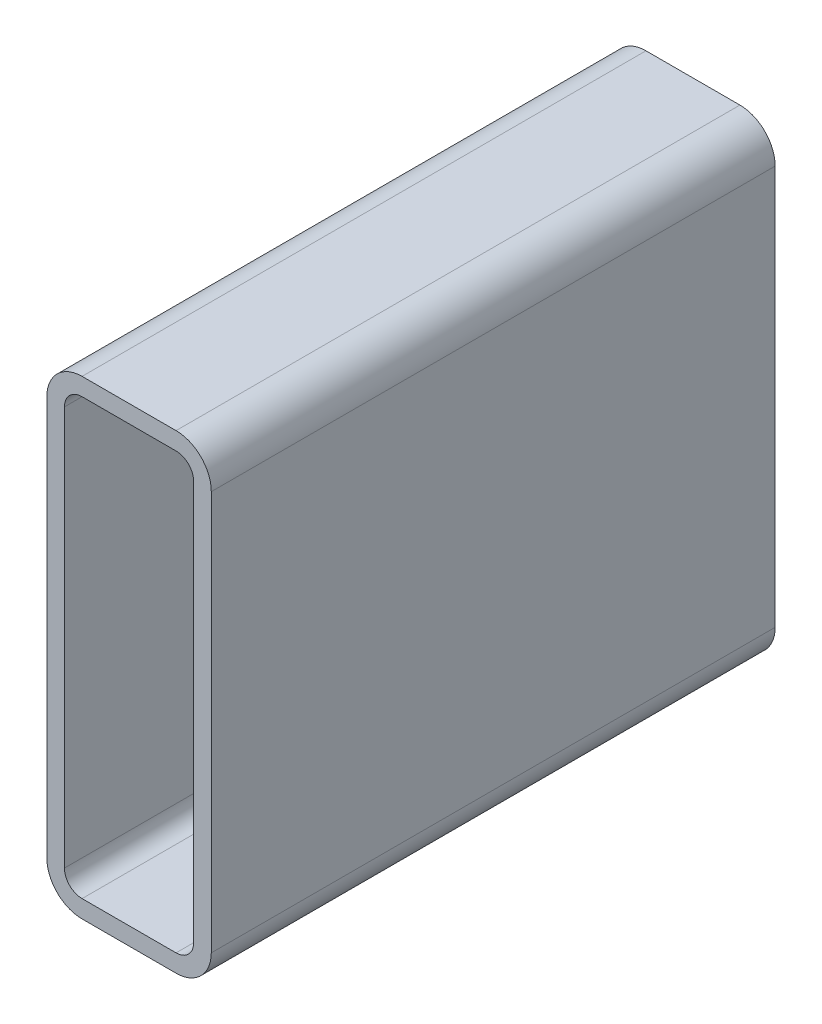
ISO-10303-21;
HEADER;
FILE_DESCRIPTION(('STEP AP214'),'2;1');
FILE_NAME('part.step','',(''),(''),'','','');
FILE_SCHEMA(('AUTOMOTIVE_DESIGN { 1 0 10303 214 1 1 1 1 }'));
ENDSEC;
DATA;
#1=APPLICATION_CONTEXT('core data for automotive mechanical design processes');
#2=APPLICATION_PROTOCOL_DEFINITION('international standard','automotive_design',2000,#1);
#3=PRODUCT_CONTEXT('',#1,'mechanical');
#4=PRODUCT('Part','Part','',(#3));
#5=PRODUCT_RELATED_PRODUCT_CATEGORY('part','',(#4));
#6=PRODUCT_DEFINITION_FORMATION('','',#4);
#7=PRODUCT_DEFINITION_CONTEXT('part definition',#1,'design');
#8=PRODUCT_DEFINITION('design','',#6,#7);
#9=PRODUCT_DEFINITION_SHAPE('','',#8);
#10=(LENGTH_UNIT() NAMED_UNIT(*) SI_UNIT(.MILLI.,.METRE.));
#11=(NAMED_UNIT(*) PLANE_ANGLE_UNIT() SI_UNIT($,.RADIAN.));
#12=(NAMED_UNIT(*) SI_UNIT($,.STERADIAN.) SOLID_ANGLE_UNIT());
#13=UNCERTAINTY_MEASURE_WITH_UNIT(LENGTH_MEASURE(1.E-05),#10,'distance_accuracy_value','');
#14=(GEOMETRIC_REPRESENTATION_CONTEXT(3) GLOBAL_UNCERTAINTY_ASSIGNED_CONTEXT((#13)) GLOBAL_UNIT_ASSIGNED_CONTEXT((#10,
#11,#12)) REPRESENTATION_CONTEXT('',''));
#15=CARTESIAN_POINT('',(0.,0.,0.));
#16=DIRECTION('',(0.,0.,1.));
#17=DIRECTION('',(1.,0.,0.));
#18=AXIS2_PLACEMENT_3D('',#15,#16,#17);
#19=CARTESIAN_POINT('',(21.1321469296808,236.870313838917,304.8));
#20=DIRECTION('',(0.,0.,1.));
#21=DIRECTION('',(1.,0.,0.));
#22=AXIS2_PLACEMENT_3D('',#19,#20,#21);
#23=PLANE('',#22);
#24=CARTESIAN_POINT('',(21.1321469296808,236.870313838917,304.8));
#25=DIRECTION('',(0.,0.,1.));
#26=DIRECTION('',(1.,0.,0.));
#27=AXIS2_PLACEMENT_3D('',#24,#25,#26);
#28=CIRCLE('',#27,19.05);
#29=CARTESIAN_POINT('',(21.1321469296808,255.920313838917,304.8));
#30=VERTEX_POINT('',#29);
#31=CARTESIAN_POINT('',(2.08214692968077,236.870313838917,304.8));
#32=VERTEX_POINT('',#31);
#33=EDGE_CURVE('E211',#30,#32,#28,.T.);
#34=ORIENTED_EDGE('',*,*,#33,.T.);
#35=DIRECTION('',(0.,-1.,0.));
#36=VECTOR('',#35,1.);
#37=CARTESIAN_POINT('',(2.08214692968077,20.9703138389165,304.8));
#38=LINE('',#37,#36);
#39=CARTESIAN_POINT('',(2.08214692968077,20.9703138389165,304.8));
#40=VERTEX_POINT('',#39);
#41=EDGE_CURVE('E214',#32,#40,#38,.T.);
#42=ORIENTED_EDGE('',*,*,#41,.T.);
#43=CARTESIAN_POINT('',(21.1321469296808,20.9703138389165,304.8));
#44=DIRECTION('',(0.,0.,1.));
#45=DIRECTION('',(1.,0.,0.));
#46=AXIS2_PLACEMENT_3D('',#43,#44,#45);
#47=CIRCLE('',#46,19.05);
#48=CARTESIAN_POINT('',(21.1321469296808,1.92031383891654,304.8));
#49=VERTEX_POINT('',#48);
#50=EDGE_CURVE('E217',#40,#49,#47,.T.);
#51=ORIENTED_EDGE('',*,*,#50,.T.);
#52=DIRECTION('',(1.,0.,0.));
#53=VECTOR('',#52,1.);
#54=CARTESIAN_POINT('',(71.9321469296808,1.92031383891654,304.8));
#55=LINE('',#54,#53);
#56=CARTESIAN_POINT('',(71.9321469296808,1.92031383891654,304.8));
#57=VERTEX_POINT('',#56);
#58=EDGE_CURVE('E219',#49,#57,#55,.T.);
#59=ORIENTED_EDGE('',*,*,#58,.T.);
#60=CARTESIAN_POINT('',(71.9321469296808,20.9703138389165,304.8));
#61=DIRECTION('',(0.,0.,1.));
#62=DIRECTION('',(1.,0.,0.));
#63=AXIS2_PLACEMENT_3D('',#60,#61,#62);
#64=CIRCLE('',#63,19.05);
#65=CARTESIAN_POINT('',(90.9821469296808,20.9703138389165,304.8));
#66=VERTEX_POINT('',#65);
#67=EDGE_CURVE('E221',#57,#66,#64,.T.);
#68=ORIENTED_EDGE('',*,*,#67,.T.);
#69=DIRECTION('',(0.,1.,0.));
#70=VECTOR('',#69,1.);
#71=CARTESIAN_POINT('',(90.9821469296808,236.870313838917,304.8));
#72=LINE('',#71,#70);
#73=CARTESIAN_POINT('',(90.9821469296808,236.870313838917,304.8));
#74=VERTEX_POINT('',#73);
#75=EDGE_CURVE('E223',#66,#74,#72,.T.);
#76=ORIENTED_EDGE('',*,*,#75,.T.);
#77=CARTESIAN_POINT('',(71.9321469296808,236.870313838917,304.8));
#78=DIRECTION('',(0.,0.,1.));
#79=DIRECTION('',(1.,0.,0.));
#80=AXIS2_PLACEMENT_3D('',#77,#78,#79);
#81=CIRCLE('',#80,19.05);
#82=CARTESIAN_POINT('',(71.9321469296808,255.920313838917,304.8));
#83=VERTEX_POINT('',#82);
#84=EDGE_CURVE('E225',#74,#83,#81,.T.);
#85=ORIENTED_EDGE('',*,*,#84,.T.);
#86=DIRECTION('',(-1.,0.,0.));
#87=VECTOR('',#86,1.);
#88=CARTESIAN_POINT('',(21.1321469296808,255.920313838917,304.8));
#89=LINE('',#88,#87);
#90=EDGE_CURVE('E227',#83,#30,#89,.T.);
#91=ORIENTED_EDGE('',*,*,#90,.T.);
#92=EDGE_LOOP('',(#34,#42,#51,#59,#68,#76,#85,#91));
#93=FACE_BOUND('',#92,.T.);
#94=DIRECTION('',(0.,-1.,0.));
#95=VECTOR('',#94,1.);
#96=CARTESIAN_POINT('',(11.6071469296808,20.9703138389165,304.8));
#97=LINE('',#96,#95);
#98=CARTESIAN_POINT('',(11.6071469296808,236.870313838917,304.8));
#99=VERTEX_POINT('',#98);
#100=CARTESIAN_POINT('',(11.6071469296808,20.9703138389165,304.8));
#101=VERTEX_POINT('',#100);
#102=EDGE_CURVE('E154',#99,#101,#97,.T.);
#103=ORIENTED_EDGE('',*,*,#102,.F.);
#104=CARTESIAN_POINT('',(21.1321469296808,236.870313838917,304.8));
#105=DIRECTION('',(0.,0.,1.));
#106=DIRECTION('',(1.,0.,0.));
#107=AXIS2_PLACEMENT_3D('',#104,#105,#106);
#108=CIRCLE('',#107,9.52500000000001);
#109=CARTESIAN_POINT('',(21.1321469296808,246.395313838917,304.8));
#110=VERTEX_POINT('',#109);
#111=EDGE_CURVE('E146',#110,#99,#108,.T.);
#112=ORIENTED_EDGE('',*,*,#111,.F.);
#113=DIRECTION('',(-1.,0.,0.));
#114=VECTOR('',#113,1.);
#115=CARTESIAN_POINT('',(21.1321469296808,246.395313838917,304.8));
#116=LINE('',#115,#114);
#117=CARTESIAN_POINT('',(71.9321469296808,246.395313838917,304.8));
#118=VERTEX_POINT('',#117);
#119=EDGE_CURVE('E179',#118,#110,#116,.T.);
#120=ORIENTED_EDGE('',*,*,#119,.F.);
#121=CARTESIAN_POINT('',(71.9321469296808,236.870313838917,304.8));
#122=DIRECTION('',(0.,0.,1.));
#123=DIRECTION('',(1.,0.,0.));
#124=AXIS2_PLACEMENT_3D('',#121,#122,#123);
#125=CIRCLE('',#124,9.525);
#126=CARTESIAN_POINT('',(81.4571469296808,236.870313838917,304.8));
#127=VERTEX_POINT('',#126);
#128=EDGE_CURVE('E177',#127,#118,#125,.T.);
#129=ORIENTED_EDGE('',*,*,#128,.F.);
#130=DIRECTION('',(0.,1.,0.));
#131=VECTOR('',#130,1.);
#132=CARTESIAN_POINT('',(81.4571469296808,236.870313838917,304.8));
#133=LINE('',#132,#131);
#134=CARTESIAN_POINT('',(81.4571469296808,20.9703138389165,304.8));
#135=VERTEX_POINT('',#134);
#136=EDGE_CURVE('E175',#135,#127,#133,.T.);
#137=ORIENTED_EDGE('',*,*,#136,.F.);
#138=CARTESIAN_POINT('',(71.9321469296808,20.9703138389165,304.8));
#139=DIRECTION('',(0.,0.,1.));
#140=DIRECTION('',(1.,0.,0.));
#141=AXIS2_PLACEMENT_3D('',#138,#139,#140);
#142=CIRCLE('',#141,9.525);
#143=CARTESIAN_POINT('',(71.9321469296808,11.4453138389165,304.8));
#144=VERTEX_POINT('',#143);
#145=EDGE_CURVE('E173',#144,#135,#142,.T.);
#146=ORIENTED_EDGE('',*,*,#145,.F.);
#147=DIRECTION('',(1.,0.,0.));
#148=VECTOR('',#147,1.);
#149=CARTESIAN_POINT('',(71.9321469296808,11.4453138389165,304.8));
#150=LINE('',#149,#148);
#151=CARTESIAN_POINT('',(21.1321469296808,11.4453138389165,304.8));
#152=VERTEX_POINT('',#151);
#153=EDGE_CURVE('E169',#152,#144,#150,.T.);
#154=ORIENTED_EDGE('',*,*,#153,.F.);
#155=CARTESIAN_POINT('',(21.1321469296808,20.9703138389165,304.8));
#156=DIRECTION('',(0.,0.,1.));
#157=DIRECTION('',(1.,0.,0.));
#158=AXIS2_PLACEMENT_3D('',#155,#156,#157);
#159=CIRCLE('',#158,9.525);
#160=EDGE_CURVE('E167',#101,#152,#159,.T.);
#161=ORIENTED_EDGE('',*,*,#160,.F.);
#162=EDGE_LOOP('',(#103,#112,#120,#129,#137,#146,#154,#161));
#163=FACE_BOUND('',#162,.T.);
#164=ADVANCED_FACE('F33',(#93,#163),#23,.T.);
#165=CARTESIAN_POINT('',(21.1321469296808,236.870313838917,0.));
#166=DIRECTION('',(0.,0.,1.));
#167=DIRECTION('',(1.,0.,0.));
#168=AXIS2_PLACEMENT_3D('',#165,#166,#167);
#169=PLANE('',#168);
#170=CARTESIAN_POINT('',(21.1321469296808,236.870313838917,0.));
#171=DIRECTION('',(0.,0.,1.));
#172=DIRECTION('',(1.,0.,0.));
#173=AXIS2_PLACEMENT_3D('',#170,#171,#172);
#174=CIRCLE('',#173,19.05);
#175=CARTESIAN_POINT('',(21.1321469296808,255.920313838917,0.));
#176=VERTEX_POINT('',#175);
#177=CARTESIAN_POINT('',(2.08214692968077,236.870313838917,0.));
#178=VERTEX_POINT('',#177);
#179=EDGE_CURVE('E162',#176,#178,#174,.T.);
#180=ORIENTED_EDGE('',*,*,#179,.F.);
#181=DIRECTION('',(-1.,0.,0.));
#182=VECTOR('',#181,1.);
#183=CARTESIAN_POINT('',(21.1321469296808,255.920313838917,0.));
#184=LINE('',#183,#182);
#185=CARTESIAN_POINT('',(71.9321469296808,255.920313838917,0.));
#186=VERTEX_POINT('',#185);
#187=EDGE_CURVE('E215',#186,#176,#184,.T.);
#188=ORIENTED_EDGE('',*,*,#187,.F.);
#189=CARTESIAN_POINT('',(71.9321469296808,236.870313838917,0.));
#190=DIRECTION('',(0.,0.,1.));
#191=DIRECTION('',(1.,0.,0.));
#192=AXIS2_PLACEMENT_3D('',#189,#190,#191);
#193=CIRCLE('',#192,19.05);
#194=CARTESIAN_POINT('',(90.9821469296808,236.870313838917,0.));
#195=VERTEX_POINT('',#194);
#196=EDGE_CURVE('E242',#195,#186,#193,.T.);
#197=ORIENTED_EDGE('',*,*,#196,.F.);
#198=DIRECTION('',(0.,1.,0.));
#199=VECTOR('',#198,1.);
#200=CARTESIAN_POINT('',(90.9821469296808,236.870313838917,0.));
#201=LINE('',#200,#199);
#202=CARTESIAN_POINT('',(90.9821469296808,20.9703138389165,0.));
#203=VERTEX_POINT('',#202);
#204=EDGE_CURVE('E240',#203,#195,#201,.T.);
#205=ORIENTED_EDGE('',*,*,#204,.F.);
#206=CARTESIAN_POINT('',(71.9321469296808,20.9703138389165,0.));
#207=DIRECTION('',(0.,0.,1.));
#208=DIRECTION('',(1.,0.,0.));
#209=AXIS2_PLACEMENT_3D('',#206,#207,#208);
#210=CIRCLE('',#209,19.05);
#211=CARTESIAN_POINT('',(71.9321469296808,1.92031383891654,0.));
#212=VERTEX_POINT('',#211);
#213=EDGE_CURVE('E238',#212,#203,#210,.T.);
#214=ORIENTED_EDGE('',*,*,#213,.F.);
#215=DIRECTION('',(1.,0.,0.));
#216=VECTOR('',#215,1.);
#217=CARTESIAN_POINT('',(71.9321469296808,1.92031383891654,0.));
#218=LINE('',#217,#216);
#219=CARTESIAN_POINT('',(21.1321469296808,1.92031383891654,0.));
#220=VERTEX_POINT('',#219);
#221=EDGE_CURVE('E236',#220,#212,#218,.T.);
#222=ORIENTED_EDGE('',*,*,#221,.F.);
#223=CARTESIAN_POINT('',(21.1321469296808,20.9703138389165,0.));
#224=DIRECTION('',(0.,0.,1.));
#225=DIRECTION('',(1.,0.,0.));
#226=AXIS2_PLACEMENT_3D('',#223,#224,#225);
#227=CIRCLE('',#226,19.05);
#228=CARTESIAN_POINT('',(2.08214692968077,20.9703138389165,0.));
#229=VERTEX_POINT('',#228);
#230=EDGE_CURVE('E234',#229,#220,#227,.T.);
#231=ORIENTED_EDGE('',*,*,#230,.F.);
#232=DIRECTION('',(0.,-1.,0.));
#233=VECTOR('',#232,1.);
#234=CARTESIAN_POINT('',(2.08214692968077,20.9703138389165,0.));
#235=LINE('',#234,#233);
#236=EDGE_CURVE('E232',#178,#229,#235,.T.);
#237=ORIENTED_EDGE('',*,*,#236,.F.);
#238=EDGE_LOOP('',(#180,#188,#197,#205,#214,#222,#231,#237));
#239=FACE_BOUND('',#238,.T.);
#240=CARTESIAN_POINT('',(21.1321469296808,236.870313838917,0.));
#241=DIRECTION('',(0.,0.,1.));
#242=DIRECTION('',(1.,0.,0.));
#243=AXIS2_PLACEMENT_3D('',#240,#241,#242);
#244=CIRCLE('',#243,9.52500000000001);
#245=CARTESIAN_POINT('',(21.1321469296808,246.395313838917,0.));
#246=VERTEX_POINT('',#245);
#247=CARTESIAN_POINT('',(11.6071469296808,236.870313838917,0.));
#248=VERTEX_POINT('',#247);
#249=EDGE_CURVE('E56',#246,#248,#244,.T.);
#250=ORIENTED_EDGE('',*,*,#249,.T.);
#251=DIRECTION('',(0.,-1.,0.));
#252=VECTOR('',#251,1.);
#253=CARTESIAN_POINT('',(11.6071469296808,20.9703138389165,0.));
#254=LINE('',#253,#252);
#255=CARTESIAN_POINT('',(11.6071469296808,20.9703138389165,0.));
#256=VERTEX_POINT('',#255);
#257=EDGE_CURVE('E161',#248,#256,#254,.T.);
#258=ORIENTED_EDGE('',*,*,#257,.T.);
#259=CARTESIAN_POINT('',(21.1321469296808,20.9703138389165,0.));
#260=DIRECTION('',(0.,0.,1.));
#261=DIRECTION('',(1.,0.,0.));
#262=AXIS2_PLACEMENT_3D('',#259,#260,#261);
#263=CIRCLE('',#262,9.525);
#264=CARTESIAN_POINT('',(21.1321469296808,11.4453138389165,0.));
#265=VERTEX_POINT('',#264);
#266=EDGE_CURVE('E183',#256,#265,#263,.T.);
#267=ORIENTED_EDGE('',*,*,#266,.T.);
#268=DIRECTION('',(1.,0.,0.));
#269=VECTOR('',#268,1.);
#270=CARTESIAN_POINT('',(71.9321469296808,11.4453138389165,0.));
#271=LINE('',#270,#269);
#272=CARTESIAN_POINT('',(71.9321469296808,11.4453138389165,0.));
#273=VERTEX_POINT('',#272);
#274=EDGE_CURVE('E186',#265,#273,#271,.T.);
#275=ORIENTED_EDGE('',*,*,#274,.T.);
#276=CARTESIAN_POINT('',(71.9321469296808,20.9703138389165,0.));
#277=DIRECTION('',(0.,0.,1.));
#278=DIRECTION('',(1.,0.,0.));
#279=AXIS2_PLACEMENT_3D('',#276,#277,#278);
#280=CIRCLE('',#279,9.525);
#281=CARTESIAN_POINT('',(81.4571469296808,20.9703138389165,0.));
#282=VERTEX_POINT('',#281);
#283=EDGE_CURVE('E189',#273,#282,#280,.T.);
#284=ORIENTED_EDGE('',*,*,#283,.T.);
#285=DIRECTION('',(0.,1.,0.));
#286=VECTOR('',#285,1.);
#287=CARTESIAN_POINT('',(81.4571469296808,236.870313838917,0.));
#288=LINE('',#287,#286);
#289=CARTESIAN_POINT('',(81.4571469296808,236.870313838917,0.));
#290=VERTEX_POINT('',#289);
#291=EDGE_CURVE('E192',#282,#290,#288,.T.);
#292=ORIENTED_EDGE('',*,*,#291,.T.);
#293=CARTESIAN_POINT('',(71.9321469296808,236.870313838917,0.));
#294=DIRECTION('',(0.,0.,1.));
#295=DIRECTION('',(1.,0.,0.));
#296=AXIS2_PLACEMENT_3D('',#293,#294,#295);
#297=CIRCLE('',#296,9.525);
#298=CARTESIAN_POINT('',(71.9321469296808,246.395313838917,0.));
#299=VERTEX_POINT('',#298);
#300=EDGE_CURVE('E195',#290,#299,#297,.T.);
#301=ORIENTED_EDGE('',*,*,#300,.T.);
#302=DIRECTION('',(-1.,0.,0.));
#303=VECTOR('',#302,1.);
#304=CARTESIAN_POINT('',(21.1321469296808,246.395313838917,0.));
#305=LINE('',#304,#303);
#306=EDGE_CURVE('E155',#299,#246,#305,.T.);
#307=ORIENTED_EDGE('',*,*,#306,.T.);
#308=EDGE_LOOP('',(#250,#258,#267,#275,#284,#292,#301,#307));
#309=FACE_BOUND('',#308,.T.);
#310=ADVANCED_FACE('F272',(#239,#309),#169,.F.);
#311=CARTESIAN_POINT('',(21.1321469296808,236.870313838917,304.8));
#312=DIRECTION('',(0.,0.,-1.));
#313=DIRECTION('',(-1.,0.,0.));
#314=AXIS2_PLACEMENT_3D('',#311,#312,#313);
#315=CYLINDRICAL_SURFACE('',#314,19.05);
#316=ORIENTED_EDGE('',*,*,#179,.T.);
#317=DIRECTION('',(0.,0.,-1.));
#318=VECTOR('',#317,1.);
#319=CARTESIAN_POINT('',(2.08214692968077,236.870313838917,304.8));
#320=LINE('',#319,#318);
#321=EDGE_CURVE('E11',#32,#178,#320,.T.);
#322=ORIENTED_EDGE('',*,*,#321,.F.);
#323=ORIENTED_EDGE('',*,*,#33,.F.);
#324=DIRECTION('',(0.,0.,-1.));
#325=VECTOR('',#324,1.);
#326=CARTESIAN_POINT('',(21.1321469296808,255.920313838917,304.8));
#327=LINE('',#326,#325);
#328=EDGE_CURVE('E229',#30,#176,#327,.T.);
#329=ORIENTED_EDGE('',*,*,#328,.T.);
#330=EDGE_LOOP('',(#316,#322,#323,#329));
#331=FACE_BOUND('',#330,.T.);
#332=ADVANCED_FACE('F35',(#331),#315,.T.);
#333=CARTESIAN_POINT('',(2.08214692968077,20.9703138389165,304.8));
#334=DIRECTION('',(1.,0.,0.));
#335=DIRECTION('',(0.,0.,-1.));
#336=AXIS2_PLACEMENT_3D('',#333,#334,#335);
#337=PLANE('',#336);
#338=ORIENTED_EDGE('',*,*,#236,.T.);
#339=DIRECTION('',(0.,0.,-1.));
#340=VECTOR('',#339,1.);
#341=CARTESIAN_POINT('',(2.08214692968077,20.9703138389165,304.8));
#342=LINE('',#341,#340);
#343=EDGE_CURVE('E41',#40,#229,#342,.T.);
#344=ORIENTED_EDGE('',*,*,#343,.F.);
#345=ORIENTED_EDGE('',*,*,#41,.F.);
#346=ORIENTED_EDGE('',*,*,#321,.T.);
#347=EDGE_LOOP('',(#338,#344,#345,#346));
#348=FACE_BOUND('',#347,.T.);
#349=ADVANCED_FACE('F289',(#348),#337,.F.);
#350=CARTESIAN_POINT('',(21.1321469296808,20.9703138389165,304.8));
#351=DIRECTION('',(0.,0.,-1.));
#352=DIRECTION('',(-1.,0.,0.));
#353=AXIS2_PLACEMENT_3D('',#350,#351,#352);
#354=CYLINDRICAL_SURFACE('',#353,19.05);
#355=ORIENTED_EDGE('',*,*,#230,.T.);
#356=DIRECTION('',(0.,0.,-1.));
#357=VECTOR('',#356,1.);
#358=CARTESIAN_POINT('',(21.1321469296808,1.92031383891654,304.8));
#359=LINE('',#358,#357);
#360=EDGE_CURVE('E259',#49,#220,#359,.T.);
#361=ORIENTED_EDGE('',*,*,#360,.F.);
#362=ORIENTED_EDGE('',*,*,#50,.F.);
#363=ORIENTED_EDGE('',*,*,#343,.T.);
#364=EDGE_LOOP('',(#355,#361,#362,#363));
#365=FACE_BOUND('',#364,.T.);
#366=ADVANCED_FACE('F266',(#365),#354,.T.);
#367=CARTESIAN_POINT('',(71.9321469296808,1.92031383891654,304.8));
#368=DIRECTION('',(0.,1.,0.));
#369=DIRECTION('',(0.,0.,1.));
#370=AXIS2_PLACEMENT_3D('',#367,#368,#369);
#371=PLANE('',#370);
#372=ORIENTED_EDGE('',*,*,#221,.T.);
#373=DIRECTION('',(0.,0.,-1.));
#374=VECTOR('',#373,1.);
#375=CARTESIAN_POINT('',(71.9321469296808,1.92031383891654,304.8));
#376=LINE('',#375,#374);
#377=EDGE_CURVE('E256',#57,#212,#376,.T.);
#378=ORIENTED_EDGE('',*,*,#377,.F.);
#379=ORIENTED_EDGE('',*,*,#58,.F.);
#380=ORIENTED_EDGE('',*,*,#360,.T.);
#381=EDGE_LOOP('',(#372,#378,#379,#380));
#382=FACE_BOUND('',#381,.T.);
#383=ADVANCED_FACE('F278',(#382),#371,.F.);
#384=CARTESIAN_POINT('',(71.9321469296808,20.9703138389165,304.8));
#385=DIRECTION('',(0.,0.,-1.));
#386=DIRECTION('',(-1.,0.,0.));
#387=AXIS2_PLACEMENT_3D('',#384,#385,#386);
#388=CYLINDRICAL_SURFACE('',#387,19.05);
#389=ORIENTED_EDGE('',*,*,#213,.T.);
#390=DIRECTION('',(0.,0.,-1.));
#391=VECTOR('',#390,1.);
#392=CARTESIAN_POINT('',(90.9821469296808,20.9703138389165,304.8));
#393=LINE('',#392,#391);
#394=EDGE_CURVE('E253',#66,#203,#393,.T.);
#395=ORIENTED_EDGE('',*,*,#394,.F.);
#396=ORIENTED_EDGE('',*,*,#67,.F.);
#397=ORIENTED_EDGE('',*,*,#377,.T.);
#398=EDGE_LOOP('',(#389,#395,#396,#397));
#399=FACE_BOUND('',#398,.T.);
#400=ADVANCED_FACE('F282',(#399),#388,.T.);
#401=CARTESIAN_POINT('',(90.9821469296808,236.870313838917,304.8));
#402=DIRECTION('',(-1.,0.,0.));
#403=DIRECTION('',(0.,0.,1.));
#404=AXIS2_PLACEMENT_3D('',#401,#402,#403);
#405=PLANE('',#404);
#406=ORIENTED_EDGE('',*,*,#204,.T.);
#407=DIRECTION('',(0.,0.,-1.));
#408=VECTOR('',#407,1.);
#409=CARTESIAN_POINT('',(90.9821469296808,236.870313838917,304.8));
#410=LINE('',#409,#408);
#411=EDGE_CURVE('E250',#74,#195,#410,.T.);
#412=ORIENTED_EDGE('',*,*,#411,.F.);
#413=ORIENTED_EDGE('',*,*,#75,.F.);
#414=ORIENTED_EDGE('',*,*,#394,.T.);
#415=EDGE_LOOP('',(#406,#412,#413,#414));
#416=FACE_BOUND('',#415,.T.);
#417=ADVANCED_FACE('F302',(#416),#405,.F.);
#418=CARTESIAN_POINT('',(71.9321469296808,236.870313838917,304.8));
#419=DIRECTION('',(0.,0.,-1.));
#420=DIRECTION('',(-1.,0.,0.));
#421=AXIS2_PLACEMENT_3D('',#418,#419,#420);
#422=CYLINDRICAL_SURFACE('',#421,19.05);
#423=ORIENTED_EDGE('',*,*,#196,.T.);
#424=DIRECTION('',(0.,0.,-1.));
#425=VECTOR('',#424,1.);
#426=CARTESIAN_POINT('',(71.9321469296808,255.920313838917,304.8));
#427=LINE('',#426,#425);
#428=EDGE_CURVE('E247',#83,#186,#427,.T.);
#429=ORIENTED_EDGE('',*,*,#428,.F.);
#430=ORIENTED_EDGE('',*,*,#84,.F.);
#431=ORIENTED_EDGE('',*,*,#411,.T.);
#432=EDGE_LOOP('',(#423,#429,#430,#431));
#433=FACE_BOUND('',#432,.T.);
#434=ADVANCED_FACE('F300',(#433),#422,.T.);
#435=CARTESIAN_POINT('',(21.1321469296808,255.920313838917,304.8));
#436=DIRECTION('',(0.,-1.,0.));
#437=DIRECTION('',(0.,0.,-1.));
#438=AXIS2_PLACEMENT_3D('',#435,#436,#437);
#439=PLANE('',#438);
#440=ORIENTED_EDGE('',*,*,#187,.T.);
#441=ORIENTED_EDGE('',*,*,#328,.F.);
#442=ORIENTED_EDGE('',*,*,#90,.F.);
#443=ORIENTED_EDGE('',*,*,#428,.T.);
#444=EDGE_LOOP('',(#440,#441,#442,#443));
#445=FACE_BOUND('',#444,.T.);
#446=ADVANCED_FACE('F295',(#445),#439,.F.);
#447=CARTESIAN_POINT('',(21.1321469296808,236.870313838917,304.8));
#448=DIRECTION('',(0.,0.,-1.));
#449=DIRECTION('',(-1.,0.,0.));
#450=AXIS2_PLACEMENT_3D('',#447,#448,#449);
#451=CYLINDRICAL_SURFACE('',#450,9.52500000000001);
#452=ORIENTED_EDGE('',*,*,#249,.F.);
#453=DIRECTION('',(0.,0.,-1.));
#454=VECTOR('',#453,1.);
#455=CARTESIAN_POINT('',(21.1321469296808,246.395313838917,304.8));
#456=LINE('',#455,#454);
#457=EDGE_CURVE('E150',#110,#246,#456,.T.);
#458=ORIENTED_EDGE('',*,*,#457,.F.);
#459=ORIENTED_EDGE('',*,*,#111,.T.);
#460=DIRECTION('',(0.,0.,-1.));
#461=VECTOR('',#460,1.);
#462=CARTESIAN_POINT('',(11.6071469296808,236.870313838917,304.8));
#463=LINE('',#462,#461);
#464=EDGE_CURVE('E149',#99,#248,#463,.T.);
#465=ORIENTED_EDGE('',*,*,#464,.T.);
#466=EDGE_LOOP('',(#452,#458,#459,#465));
#467=FACE_BOUND('',#466,.T.);
#468=ADVANCED_FACE('F148',(#467),#451,.F.);
#469=CARTESIAN_POINT('',(11.6071469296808,20.9703138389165,304.8));
#470=DIRECTION('',(1.,0.,0.));
#471=DIRECTION('',(0.,0.,-1.));
#472=AXIS2_PLACEMENT_3D('',#469,#470,#471);
#473=PLANE('',#472);
#474=ORIENTED_EDGE('',*,*,#257,.F.);
#475=ORIENTED_EDGE('',*,*,#464,.F.);
#476=ORIENTED_EDGE('',*,*,#102,.T.);
#477=DIRECTION('',(0.,0.,-1.));
#478=VECTOR('',#477,1.);
#479=CARTESIAN_POINT('',(11.6071469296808,20.9703138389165,304.8));
#480=LINE('',#479,#478);
#481=EDGE_CURVE('E163',#101,#256,#480,.T.);
#482=ORIENTED_EDGE('',*,*,#481,.T.);
#483=EDGE_LOOP('',(#474,#475,#476,#482));
#484=FACE_BOUND('',#483,.T.);
#485=ADVANCED_FACE('F158',(#484),#473,.T.);
#486=CARTESIAN_POINT('',(21.1321469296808,20.9703138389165,304.8));
#487=DIRECTION('',(0.,0.,-1.));
#488=DIRECTION('',(-1.,0.,0.));
#489=AXIS2_PLACEMENT_3D('',#486,#487,#488);
#490=CYLINDRICAL_SURFACE('',#489,9.525);
#491=ORIENTED_EDGE('',*,*,#266,.F.);
#492=ORIENTED_EDGE('',*,*,#481,.F.);
#493=ORIENTED_EDGE('',*,*,#160,.T.);
#494=DIRECTION('',(0.,0.,-1.));
#495=VECTOR('',#494,1.);
#496=CARTESIAN_POINT('',(21.1321469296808,11.4453138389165,304.8));
#497=LINE('',#496,#495);
#498=EDGE_CURVE('E208',#152,#265,#497,.T.);
#499=ORIENTED_EDGE('',*,*,#498,.T.);
#500=EDGE_LOOP('',(#491,#492,#493,#499));
#501=FACE_BOUND('',#500,.T.);
#502=ADVANCED_FACE('F327',(#501),#490,.F.);
#503=CARTESIAN_POINT('',(71.9321469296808,11.4453138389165,304.8));
#504=DIRECTION('',(0.,1.,0.));
#505=DIRECTION('',(0.,0.,1.));
#506=AXIS2_PLACEMENT_3D('',#503,#504,#505);
#507=PLANE('',#506);
#508=ORIENTED_EDGE('',*,*,#274,.F.);
#509=ORIENTED_EDGE('',*,*,#498,.F.);
#510=ORIENTED_EDGE('',*,*,#153,.T.);
#511=DIRECTION('',(0.,0.,-1.));
#512=VECTOR('',#511,1.);
#513=CARTESIAN_POINT('',(71.9321469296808,11.4453138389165,304.8));
#514=LINE('',#513,#512);
#515=EDGE_CURVE('E206',#144,#273,#514,.T.);
#516=ORIENTED_EDGE('',*,*,#515,.T.);
#517=EDGE_LOOP('',(#508,#509,#510,#516));
#518=FACE_BOUND('',#517,.T.);
#519=ADVANCED_FACE('F331',(#518),#507,.T.);
#520=CARTESIAN_POINT('',(71.9321469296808,20.9703138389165,304.8));
#521=DIRECTION('',(0.,0.,-1.));
#522=DIRECTION('',(-1.,0.,0.));
#523=AXIS2_PLACEMENT_3D('',#520,#521,#522);
#524=CYLINDRICAL_SURFACE('',#523,9.525);
#525=ORIENTED_EDGE('',*,*,#283,.F.);
#526=ORIENTED_EDGE('',*,*,#515,.F.);
#527=ORIENTED_EDGE('',*,*,#145,.T.);
#528=DIRECTION('',(0.,0.,-1.));
#529=VECTOR('',#528,1.);
#530=CARTESIAN_POINT('',(81.4571469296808,20.9703138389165,304.8));
#531=LINE('',#530,#529);
#532=EDGE_CURVE('E204',#135,#282,#531,.T.);
#533=ORIENTED_EDGE('',*,*,#532,.T.);
#534=EDGE_LOOP('',(#525,#526,#527,#533));
#535=FACE_BOUND('',#534,.T.);
#536=ADVANCED_FACE('F337',(#535),#524,.F.);
#537=CARTESIAN_POINT('',(81.4571469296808,236.870313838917,304.8));
#538=DIRECTION('',(-1.,0.,0.));
#539=DIRECTION('',(0.,0.,1.));
#540=AXIS2_PLACEMENT_3D('',#537,#538,#539);
#541=PLANE('',#540);
#542=ORIENTED_EDGE('',*,*,#291,.F.);
#543=ORIENTED_EDGE('',*,*,#532,.F.);
#544=ORIENTED_EDGE('',*,*,#136,.T.);
#545=DIRECTION('',(0.,0.,-1.));
#546=VECTOR('',#545,1.);
#547=CARTESIAN_POINT('',(81.4571469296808,236.870313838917,304.8));
#548=LINE('',#547,#546);
#549=EDGE_CURVE('E202',#127,#290,#548,.T.);
#550=ORIENTED_EDGE('',*,*,#549,.T.);
#551=EDGE_LOOP('',(#542,#543,#544,#550));
#552=FACE_BOUND('',#551,.T.);
#553=ADVANCED_FACE('F341',(#552),#541,.T.);
#554=CARTESIAN_POINT('',(71.9321469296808,236.870313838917,304.8));
#555=DIRECTION('',(0.,0.,-1.));
#556=DIRECTION('',(-1.,0.,0.));
#557=AXIS2_PLACEMENT_3D('',#554,#555,#556);
#558=CYLINDRICAL_SURFACE('',#557,9.525);
#559=ORIENTED_EDGE('',*,*,#300,.F.);
#560=ORIENTED_EDGE('',*,*,#549,.F.);
#561=ORIENTED_EDGE('',*,*,#128,.T.);
#562=DIRECTION('',(0.,0.,-1.));
#563=VECTOR('',#562,1.);
#564=CARTESIAN_POINT('',(71.9321469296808,246.395313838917,304.8));
#565=LINE('',#564,#563);
#566=EDGE_CURVE('E48',#118,#299,#565,.T.);
#567=ORIENTED_EDGE('',*,*,#566,.T.);
#568=EDGE_LOOP('',(#559,#560,#561,#567));
#569=FACE_BOUND('',#568,.T.);
#570=ADVANCED_FACE('F345',(#569),#558,.F.);
#571=CARTESIAN_POINT('',(21.1321469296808,246.395313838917,304.8));
#572=DIRECTION('',(0.,-1.,0.));
#573=DIRECTION('',(0.,0.,-1.));
#574=AXIS2_PLACEMENT_3D('',#571,#572,#573);
#575=PLANE('',#574);
#576=ORIENTED_EDGE('',*,*,#306,.F.);
#577=ORIENTED_EDGE('',*,*,#566,.F.);
#578=ORIENTED_EDGE('',*,*,#119,.T.);
#579=ORIENTED_EDGE('',*,*,#457,.T.);
#580=EDGE_LOOP('',(#576,#577,#578,#579));
#581=FACE_BOUND('',#580,.T.);
#582=ADVANCED_FACE('F349',(#581),#575,.T.);
#583=CLOSED_SHELL('',(#164,#310,#332,#349,#366,#383,#400,#417,#434,#446,#468,#485,#502,#519,
#536,#553,#570,#582));
#584=MANIFOLD_SOLID_BREP('B2',#583);
#585=ADVANCED_BREP_SHAPE_REPRESENTATION('',(#18,#584),#14);
#586=SHAPE_DEFINITION_REPRESENTATION(#9,#585);
ENDSEC;
END-ISO-10303-21;
